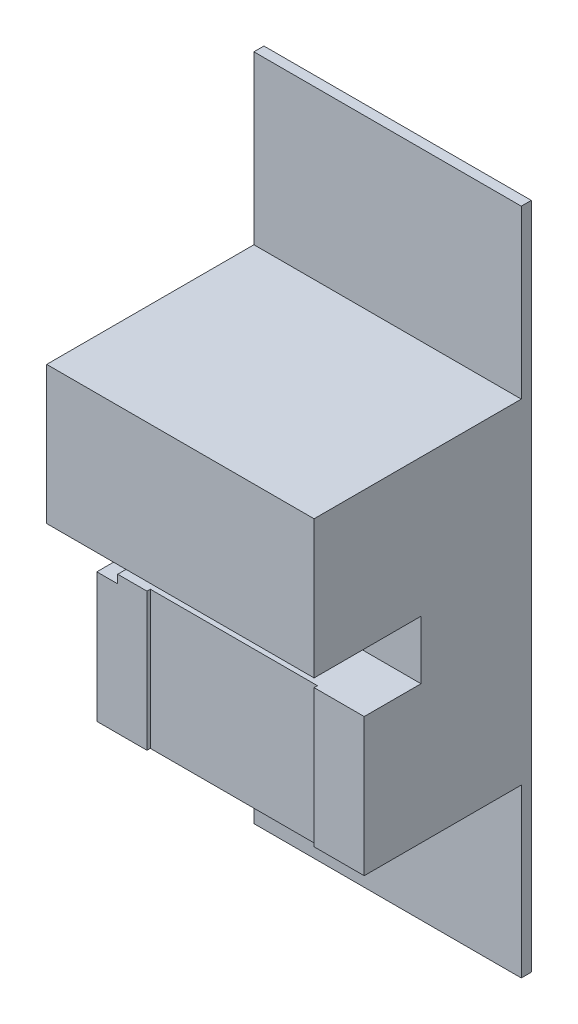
from build123d import *

# Parameters (mm, degrees)
SKETCH2_W           = 16
SKETCH2_H           = 40
BOSS_EXTRUDE1_DEPTH = 10
SKETCH3_W           = 16
SKETCH3_H           = 3.5
CUT_EXTRUDE1_DEPTH  = 3.4
CUT_EXTRUDE3_START  = -18.25
CUT_EXTRUDE3_DEPTH  = 3.4
SKETCH5_W           = 16
SKETCH5_H           = 10
CUT_EXTRUDE4_DEPTH  = 9.4
SKETCH6_W           = 10
SKETCH6_H           = 9
CUT_EXTRUDE5_DEPTH  = 0.2
SKETCH7_W           = 16
SKETCH7_H           = 8.25
BOSS_EXTRUDE2_DEPTH = 3
SKETCH8_W           = 1.25
SKETCH8_H           = 0.5
CUT_EXTRUDE6_DEPTH  = 1


with BuildPart() as part:
    # Sketch2 → Boss-Extrude1 (new body)
    with BuildSketch(Plane.XY):
        with Locations((8, 20)):
            Rectangle(SKETCH2_W, SKETCH2_H)
    extrude(amount=BOSS_EXTRUDE1_DEPTH)

    # Sketch3 → Cut-Extrude1 (cut)
    with BuildSketch(Plane.XY.offset(10)):
        with Locations((8, 20)):
            Rectangle(SKETCH3_W, SKETCH3_H)
    extrude(amount=-CUT_EXTRUDE1_DEPTH, mode=Mode.SUBTRACT)

    # Sketch4 → Cut-Extrude3 (cut)
    with BuildSketch(Plane(origin=(0, 40, 0), x_dir=(1, 0, 0), z_dir=(0, 1, 0)).offset(CUT_EXTRUDE3_START)):
        with BuildLine():
            Line((6.2, -14.4), (6.2, -5.6))
            ThreePointArc((6.2, -5.6), (8, -3.8), (9.8, -5.6))
            Line((9.8, -5.6), (9.8, -14.4))
            ThreePointArc((9.8, -14.4), (8, -16.2), (6.2, -14.4))
        make_face()
    extrude(amount=-CUT_EXTRUDE3_DEPTH, mode=Mode.SUBTRACT)

    # Sketch5 → Cut-Extrude4 (cut)
    with BuildSketch(Plane.XY.offset(10)):
        with Locations((8, 35)):
            Rectangle(SKETCH5_W, SKETCH5_H)
        with Locations((8, 5)):
            Rectangle(SKETCH5_W, SKETCH5_H)
    extrude(amount=-CUT_EXTRUDE4_DEPTH, mode=Mode.SUBTRACT)

    # Sketch6 → Cut-Extrude5 (cut)
    with BuildSketch(Plane.XY.offset(10)):
        with Locations((8, 13.75)):
            Rectangle(SKETCH6_W, SKETCH6_H)
    extrude(amount=-CUT_EXTRUDE5_DEPTH, mode=Mode.SUBTRACT)

    # Sketch7 → Boss-Extrude2 (add)
    with BuildSketch(Plane.XY.offset(10)):
        with Locations((8, 25.875)):
            Rectangle(SKETCH7_W, SKETCH7_H)
    extrude(amount=BOSS_EXTRUDE2_DEPTH)

    # Sketch8 → Cut-Extrude6 (cut)
    with BuildSketch(Plane.XY.offset(10)):
        with Locations((0.625, 18)):
            Rectangle(SKETCH8_W, SKETCH8_H)
    extrude(amount=-CUT_EXTRUDE6_DEPTH, mode=Mode.SUBTRACT)


solid = part.part
